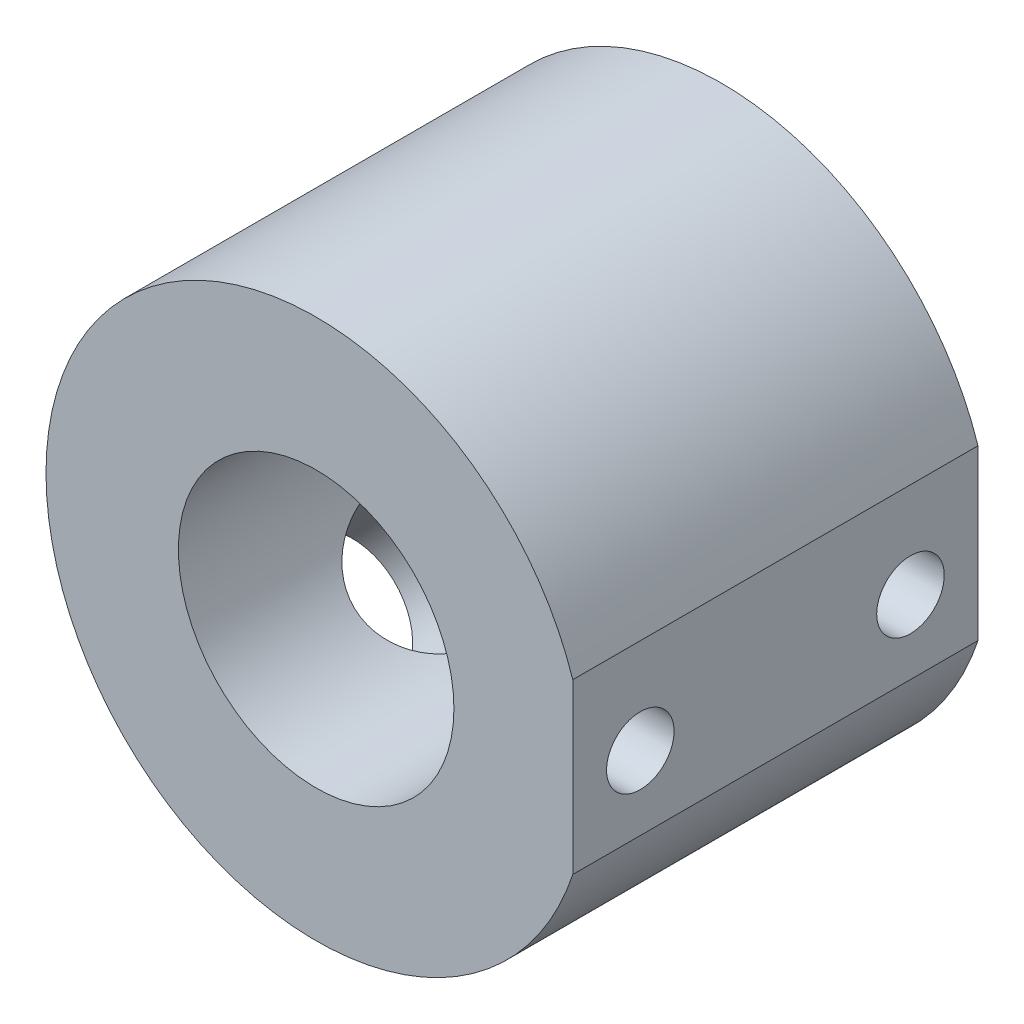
ISO-10303-21;
HEADER;
FILE_DESCRIPTION(('STEP AP214'),'2;1');
FILE_NAME('part.step','',(''),(''),'','','');
FILE_SCHEMA(('AUTOMOTIVE_DESIGN { 1 0 10303 214 1 1 1 1 }'));
ENDSEC;
DATA;
#1=APPLICATION_CONTEXT('core data for automotive mechanical design processes');
#2=APPLICATION_PROTOCOL_DEFINITION('international standard','automotive_design',2000,#1);
#3=PRODUCT_CONTEXT('',#1,'mechanical');
#4=PRODUCT('Part','Part','',(#3));
#5=PRODUCT_RELATED_PRODUCT_CATEGORY('part','',(#4));
#6=PRODUCT_DEFINITION_FORMATION('','',#4);
#7=PRODUCT_DEFINITION_CONTEXT('part definition',#1,'design');
#8=PRODUCT_DEFINITION('design','',#6,#7);
#9=PRODUCT_DEFINITION_SHAPE('','',#8);
#10=(LENGTH_UNIT() NAMED_UNIT(*) SI_UNIT(.MILLI.,.METRE.));
#11=(NAMED_UNIT(*) PLANE_ANGLE_UNIT() SI_UNIT($,.RADIAN.));
#12=(NAMED_UNIT(*) SI_UNIT($,.STERADIAN.) SOLID_ANGLE_UNIT());
#13=UNCERTAINTY_MEASURE_WITH_UNIT(LENGTH_MEASURE(1.E-05),#10,'distance_accuracy_value','');
#14=(GEOMETRIC_REPRESENTATION_CONTEXT(3) GLOBAL_UNCERTAINTY_ASSIGNED_CONTEXT((#13)) GLOBAL_UNIT_ASSIGNED_CONTEXT((#10,
#11,#12)) REPRESENTATION_CONTEXT('',''));
#15=CARTESIAN_POINT('',(0.,0.,0.));
#16=DIRECTION('',(0.,0.,1.));
#17=DIRECTION('',(1.,0.,0.));
#18=AXIS2_PLACEMENT_3D('',#15,#16,#17);
#19=CARTESIAN_POINT('',(0.,0.,7.5));
#20=DIRECTION('',(0.,0.,1.));
#21=DIRECTION('',(1.,0.,0.));
#22=AXIS2_PLACEMENT_3D('',#19,#20,#21);
#23=PLANE('',#22);
#24=DIRECTION('',(0.,-1.,0.));
#25=VECTOR('',#24,1.);
#26=CARTESIAN_POINT('',(9.5,0.,7.5));
#27=LINE('',#26,#25);
#28=CARTESIAN_POINT('',(9.5,3.12249899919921,7.5));
#29=VERTEX_POINT('',#28);
#30=CARTESIAN_POINT('',(9.5,-3.12249899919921,7.5));
#31=VERTEX_POINT('',#30);
#32=EDGE_CURVE('E55',#29,#31,#27,.T.);
#33=ORIENTED_EDGE('',*,*,#32,.F.);
#34=CARTESIAN_POINT('',(0.,0.,7.5));
#35=DIRECTION('',(0.,0.,1.));
#36=DIRECTION('',(1.,0.,0.));
#37=AXIS2_PLACEMENT_3D('',#34,#35,#36);
#38=CIRCLE('',#37,10.);
#39=EDGE_CURVE('E11',#29,#31,#38,.T.);
#40=ORIENTED_EDGE('',*,*,#39,.T.);
#41=EDGE_LOOP('',(#33,#40));
#42=FACE_BOUND('',#41,.T.);
#43=CARTESIAN_POINT('',(0.,0.,7.5));
#44=DIRECTION('',(0.,0.,1.));
#45=DIRECTION('',(1.,0.,0.));
#46=AXIS2_PLACEMENT_3D('',#43,#44,#45);
#47=CIRCLE('',#46,5.1);
#48=CARTESIAN_POINT('',(5.1,0.,7.5));
#49=VERTEX_POINT('',#48);
#50=EDGE_CURVE('E78',#49,#49,#47,.T.);
#51=ORIENTED_EDGE('',*,*,#50,.F.);
#52=EDGE_LOOP('',(#51));
#53=FACE_BOUND('',#52,.T.);
#54=ADVANCED_FACE('F37',(#42,#53),#23,.T.);
#55=CARTESIAN_POINT('',(0.,0.,-7.5));
#56=DIRECTION('',(0.,0.,1.));
#57=DIRECTION('',(1.,0.,0.));
#58=AXIS2_PLACEMENT_3D('',#55,#56,#57);
#59=PLANE('',#58);
#60=CARTESIAN_POINT('',(0.,0.,-7.5));
#61=DIRECTION('',(0.,0.,1.));
#62=DIRECTION('',(1.,0.,0.));
#63=AXIS2_PLACEMENT_3D('',#60,#61,#62);
#64=CIRCLE('',#63,10.);
#65=CARTESIAN_POINT('',(9.5,3.12249899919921,-7.5));
#66=VERTEX_POINT('',#65);
#67=CARTESIAN_POINT('',(9.5,-3.12249899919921,-7.5));
#68=VERTEX_POINT('',#67);
#69=EDGE_CURVE('E47',#66,#68,#64,.T.);
#70=ORIENTED_EDGE('',*,*,#69,.F.);
#71=DIRECTION('',(0.,-1.,0.));
#72=VECTOR('',#71,1.);
#73=CARTESIAN_POINT('',(9.5,0.,-7.5));
#74=LINE('',#73,#72);
#75=EDGE_CURVE('E67',#66,#68,#74,.T.);
#76=ORIENTED_EDGE('',*,*,#75,.T.);
#77=EDGE_LOOP('',(#70,#76));
#78=FACE_BOUND('',#77,.T.);
#79=CARTESIAN_POINT('',(0.,0.,-7.5));
#80=DIRECTION('',(0.,0.,1.));
#81=DIRECTION('',(1.,0.,0.));
#82=AXIS2_PLACEMENT_3D('',#79,#80,#81);
#83=CIRCLE('',#82,5.1);
#84=CARTESIAN_POINT('',(5.1,0.,-7.5));
#85=VERTEX_POINT('',#84);
#86=EDGE_CURVE('E81',#85,#85,#83,.T.);
#87=ORIENTED_EDGE('',*,*,#86,.T.);
#88=EDGE_LOOP('',(#87));
#89=FACE_BOUND('',#88,.T.);
#90=ADVANCED_FACE('F75',(#78,#89),#59,.F.);
#91=CARTESIAN_POINT('',(0.,0.,7.5));
#92=DIRECTION('',(0.,0.,-1.));
#93=DIRECTION('',(-1.,0.,0.));
#94=AXIS2_PLACEMENT_3D('',#91,#92,#93);
#95=CYLINDRICAL_SURFACE('',#94,10.);
#96=CARTESIAN_POINT('',(-8.61429892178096,-5.07876501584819,0.));
#97=CARTESIAN_POINT('',(-8.6142980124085,-5.07876965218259,0.138050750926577));
#98=CARTESIAN_POINT('',(-8.6082962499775,-5.0889886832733,0.276144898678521));
#99=CARTESIAN_POINT('',(-8.58430584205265,-5.12934940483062,0.548367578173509));
#100=CARTESIAN_POINT('',(-8.56631022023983,-5.15950269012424,0.682493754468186));
#101=CARTESIAN_POINT('',(-8.51842944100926,-5.23817352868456,0.942803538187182));
#102=CARTESIAN_POINT('',(-8.48855963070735,-5.28666737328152,1.06899715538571));
#103=CARTESIAN_POINT('',(-8.41704773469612,-5.39979320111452,1.31031085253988));
#104=CARTESIAN_POINT('',(-8.37540514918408,-5.46442586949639,1.42543046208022));
#105=CARTESIAN_POINT('',(-8.27959503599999,-5.60855796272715,1.64386164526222));
#106=CARTESIAN_POINT('',(-8.22519538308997,-5.68832692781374,1.74689360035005));
#107=CARTESIAN_POINT('',(-8.10472415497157,-5.85869554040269,1.93576139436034));
#108=CARTESIAN_POINT('',(-8.03865148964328,-5.94929619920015,2.02159562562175));
#109=CARTESIAN_POINT('',(-7.89452855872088,-6.13928418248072,2.17477546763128));
#110=CARTESIAN_POINT('',(-7.81632402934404,-6.23877647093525,2.24184638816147));
#111=CARTESIAN_POINT('',(-7.64988513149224,-6.44177455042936,2.35380964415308));
#112=CARTESIAN_POINT('',(-7.56165224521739,-6.54527974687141,2.39870525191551));
#113=CARTESIAN_POINT('',(-7.3789465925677,-6.75052840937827,2.46414783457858));
#114=CARTESIAN_POINT('',(-7.28463644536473,-6.85226508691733,2.48516964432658));
#115=CARTESIAN_POINT('',(-7.09070046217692,-7.05275878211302,2.50375837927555));
#116=CARTESIAN_POINT('',(-6.99107541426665,-7.15151623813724,2.5013287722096));
#117=CARTESIAN_POINT('',(-6.7917608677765,-7.34101400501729,2.47342514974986));
#118=CARTESIAN_POINT('',(-6.69212185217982,-7.43188358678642,2.44846367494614));
#119=CARTESIAN_POINT('',(-6.49375949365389,-7.60582013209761,2.3770287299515));
#120=CARTESIAN_POINT('',(-6.39503619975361,-7.68888668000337,2.33055411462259));
#121=CARTESIAN_POINT('',(-6.20087274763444,-7.84633392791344,2.21699742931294));
#122=CARTESIAN_POINT('',(-6.10547031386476,-7.92062936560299,2.14973295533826));
#123=CARTESIAN_POINT('',(-5.92216777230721,-8.05860472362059,1.99664432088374));
#124=CARTESIAN_POINT('',(-5.83426897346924,-8.12228279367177,1.91081693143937));
#125=CARTESIAN_POINT('',(-5.66689661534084,-8.23996639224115,1.72029125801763));
#126=CARTESIAN_POINT('',(-5.5877154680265,-8.29366349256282,1.61514510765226));
#127=CARTESIAN_POINT('',(-5.44380969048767,-8.38882591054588,1.39040002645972));
#128=CARTESIAN_POINT('',(-5.37908573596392,-8.43029065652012,1.2708004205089));
#129=CARTESIAN_POINT('',(-5.26669722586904,-8.50096167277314,1.01970996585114));
#130=CARTESIAN_POINT('',(-5.21911691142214,-8.53010752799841,0.888164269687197));
#131=CARTESIAN_POINT('',(-5.14382872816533,-8.57572065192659,0.617414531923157));
#132=CARTESIAN_POINT('',(-5.11611660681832,-8.59219063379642,0.478212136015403));
#133=CARTESIAN_POINT('',(-5.08248832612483,-8.61212445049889,0.200040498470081));
#134=CARTESIAN_POINT('',(-5.07601582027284,-8.61592031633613,0.0611622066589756));
#135=CARTESIAN_POINT('',(-5.08364269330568,-8.61142245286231,-0.215821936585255));
#136=CARTESIAN_POINT('',(-5.09774017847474,-8.60312983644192,-0.353927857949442));
#137=CARTESIAN_POINT('',(-5.14536527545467,-8.57472775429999,-0.623114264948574));
#138=CARTESIAN_POINT('',(-5.17857120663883,-8.55481385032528,-0.754272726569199));
#139=CARTESIAN_POINT('',(-5.26256380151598,-8.50340117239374,-1.00843145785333));
#140=CARTESIAN_POINT('',(-5.31335254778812,-8.47190102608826,-1.13143075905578));
#141=CARTESIAN_POINT('',(-5.43142203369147,-8.39670354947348,-1.3684412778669));
#142=CARTESIAN_POINT('',(-5.49900675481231,-8.35277906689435,-1.48222884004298));
#143=CARTESIAN_POINT('',(-5.64732251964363,-8.25322417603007,-1.69518836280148));
#144=CARTESIAN_POINT('',(-5.72805572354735,-8.1975918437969,-1.79435791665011));
#145=CARTESIAN_POINT('',(-5.90173750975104,-8.07348418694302,-1.97781104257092));
#146=CARTESIAN_POINT('',(-5.99494119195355,-8.00472234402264,-2.0616600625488));
#147=CARTESIAN_POINT('',(-6.18839734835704,-7.85611817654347,-2.20893586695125));
#148=CARTESIAN_POINT('',(-6.28864945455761,-7.77627643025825,-2.27236371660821));
#149=CARTESIAN_POINT('',(-6.49180993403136,-7.60747665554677,-2.37644603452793));
#150=CARTESIAN_POINT('',(-6.5946934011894,-7.518589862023,-2.41726428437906));
#151=CARTESIAN_POINT('',(-6.80023073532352,-7.33321162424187,-2.47546033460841));
#152=CARTESIAN_POINT('',(-6.9028846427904,-7.23672165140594,-2.49284265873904));
#153=CARTESIAN_POINT('',(-7.10187154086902,-7.04147215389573,-2.50341897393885));
#154=CARTESIAN_POINT('',(-7.19830039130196,-6.94284453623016,-2.49725427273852));
#155=CARTESIAN_POINT('',(-7.38506999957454,-6.74383906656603,-2.46238043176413));
#156=CARTESIAN_POINT('',(-7.47541093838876,-6.64346126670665,-2.43367196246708));
#157=CARTESIAN_POINT('',(-7.6474046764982,-6.44471844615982,-2.35486945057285));
#158=CARTESIAN_POINT('',(-7.72910162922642,-6.34634549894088,-2.30489136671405));
#159=CARTESIAN_POINT('',(-7.88287932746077,-6.15429650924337,-2.18507355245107));
#160=CARTESIAN_POINT('',(-7.95495885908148,-6.06062106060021,-2.11523131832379));
#161=CARTESIAN_POINT('',(-8.0901402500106,-5.87901052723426,-1.95571191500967));
#162=CARTESIAN_POINT('',(-8.15298566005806,-5.79126672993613,-1.86559964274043));
#163=CARTESIAN_POINT('',(-8.26700018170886,-5.62731746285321,-1.66894287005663));
#164=CARTESIAN_POINT('',(-8.31816632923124,-5.55111492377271,-1.56239420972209));
#165=CARTESIAN_POINT('',(-8.40933242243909,-5.41204103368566,-1.33349646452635));
#166=CARTESIAN_POINT('',(-8.44910624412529,-5.34944491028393,-1.21088969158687));
#167=CARTESIAN_POINT('',(-8.51598121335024,-5.24233527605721,-0.954861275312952));
#168=CARTESIAN_POINT('',(-8.54309158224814,-5.19780861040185,-0.821447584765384));
#169=CARTESIAN_POINT('',(-8.58063758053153,-5.13553369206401,-0.573557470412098));
#170=CARTESIAN_POINT('',(-8.59325622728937,-5.11431500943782,-0.460267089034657));
#171=CARTESIAN_POINT('',(-8.61008692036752,-5.08592932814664,-0.231327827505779));
#172=CARTESIAN_POINT('',(-8.61429968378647,-5.07876113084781,-0.115679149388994));
#173=CARTESIAN_POINT('',(-8.61429892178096,-5.07876501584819,0.));
#174=B_SPLINE_CURVE_WITH_KNOTS('',3,(#96,#97,#98,#99,#100,#101,#102,#103,#104,#105,#106,#107,
#108,#109,#110,#111,#112,#113,#114,#115,#116,#117,#118,#119,#120,#121,#122,#123,#124,#125,#126,
#127,#128,#129,#130,#131,#132,#133,#134,#135,#136,#137,#138,#139,#140,#141,#142,#143,#144,#145,
#146,#147,#148,#149,#150,#151,#152,#153,#154,#155,#156,#157,#158,#159,#160,#161,#162,#163,#164,
#165,#166,#167,#168,#169,#170,#171,#172,#173),.UNSPECIFIED.,.T.,.F.,(4,2,2,2,2,2,2,2,2,2,2,2,2,
2,2,2,2,2,2,2,2,2,2,2,2,2,2,2,2,2,2,2,2,2,2,2,2,2,4),(0.,0.413727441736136,0.827695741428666,
1.24113072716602,1.65458326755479,2.07623954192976,2.49793521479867,2.9255149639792,
3.35303159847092,3.77188750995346,4.19068148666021,4.60018262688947,5.00970556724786,
5.42292874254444,5.83622385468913,6.26070466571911,6.68520531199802,7.11176432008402,
7.53823200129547,7.95343574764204,8.36860127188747,8.77697405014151,9.18539521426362,
9.60182845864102,10.0183301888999,10.4452533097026,10.872154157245,11.2959207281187,
11.7196054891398,12.131834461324,12.5440511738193,12.9540487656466,13.3640980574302,
13.7839709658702,14.2039503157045,14.6317647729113,15.0592672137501,15.4059782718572,
15.7526597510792),.UNSPECIFIED.);
#175=CARTESIAN_POINT('',(-8.61429892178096,-5.07876501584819,0.));
#176=VERTEX_POINT('',#175);
#177=EDGE_CURVE('E118',#176,#176,#174,.T.);
#178=ORIENTED_EDGE('',*,*,#177,.T.);
#179=EDGE_LOOP('',(#178));
#180=FACE_BOUND('',#179,.T.);
#181=ORIENTED_EDGE('',*,*,#39,.F.);
#182=DIRECTION('',(0.,0.,-1.));
#183=VECTOR('',#182,1.);
#184=CARTESIAN_POINT('',(9.5,3.12249899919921,7.5));
#185=LINE('',#184,#183);
#186=EDGE_CURVE('E60',#29,#66,#185,.T.);
#187=ORIENTED_EDGE('',*,*,#186,.T.);
#188=ORIENTED_EDGE('',*,*,#69,.T.);
#189=DIRECTION('',(0.,0.,-1.));
#190=VECTOR('',#189,1.);
#191=CARTESIAN_POINT('',(9.5,-3.12249899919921,7.5));
#192=LINE('',#191,#190);
#193=EDGE_CURVE('E64',#68,#31,#192,.F.);
#194=ORIENTED_EDGE('',*,*,#193,.T.);
#195=EDGE_LOOP('',(#181,#187,#188,#194));
#196=FACE_BOUND('',#195,.T.);
#197=ADVANCED_FACE('F39',(#180,#196),#95,.T.);
#198=CARTESIAN_POINT('',(0.,0.,7.5));
#199=DIRECTION('',(0.,0.,-1.));
#200=DIRECTION('',(-1.,0.,0.));
#201=AXIS2_PLACEMENT_3D('',#198,#199,#200);
#202=CYLINDRICAL_SURFACE('',#201,5.1);
#203=CARTESIAN_POINT('',(-4.91101368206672,-1.37547977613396,0.));
#204=CARTESIAN_POINT('',(-4.91101506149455,-1.37549540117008,0.130659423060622));
#205=CARTESIAN_POINT('',(-4.90785749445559,-1.38690665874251,0.261497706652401));
#206=CARTESIAN_POINT('',(-4.89499868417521,-1.43160546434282,0.519187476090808));
#207=CARTESIAN_POINT('',(-4.88528315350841,-1.46494077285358,0.646029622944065));
#208=CARTESIAN_POINT('',(-4.85875019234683,-1.55065442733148,0.891520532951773));
#209=CARTESIAN_POINT('',(-4.84196931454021,-1.60293457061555,1.01020786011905));
#210=CARTESIAN_POINT('',(-4.80044356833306,-1.72330561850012,1.23767586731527));
#211=CARTESIAN_POINT('',(-4.77569853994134,-1.79139684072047,1.34645634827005));
#212=CARTESIAN_POINT('',(-4.7149089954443,-1.94603632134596,1.560533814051));
#213=CARTESIAN_POINT('',(-4.67812546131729,-2.03361855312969,1.66487448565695));
#214=CARTESIAN_POINT('',(-4.5928154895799,-2.21957482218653,1.85806528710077));
#215=CARTESIAN_POINT('',(-4.54428341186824,-2.31795403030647,1.94690794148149));
#216=CARTESIAN_POINT('',(-4.43090341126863,-2.52828923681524,2.11215445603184));
#217=CARTESIAN_POINT('',(-4.36520832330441,-2.64071135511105,2.18739423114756));
#218=CARTESIAN_POINT('',(-4.21887020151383,-2.86869840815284,2.31518348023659));
#219=CARTESIAN_POINT('',(-4.13823628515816,-2.98426138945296,2.36774672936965));
#220=CARTESIAN_POINT('',(-3.96893372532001,-3.20556032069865,2.44494402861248));
#221=CARTESIAN_POINT('',(-3.8812002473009,-3.31142513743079,2.47125156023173));
#222=CARTESIAN_POINT('',(-3.69562082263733,-3.51732163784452,2.50068895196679));
#223=CARTESIAN_POINT('',(-3.59778075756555,-3.61735666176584,2.5038322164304));
#224=CARTESIAN_POINT('',(-3.40379216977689,-3.80006235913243,2.48752707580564));
#225=CARTESIAN_POINT('',(-3.30818695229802,-3.88348559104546,2.46994674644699));
#226=CARTESIAN_POINT('',(-3.11433962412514,-4.04060125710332,2.41601870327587));
#227=CARTESIAN_POINT('',(-3.01609731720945,-4.11429296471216,2.37966958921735));
#228=CARTESIAN_POINT('',(-2.81879945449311,-4.25194770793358,2.28896538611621));
#229=CARTESIAN_POINT('',(-2.71975221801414,-4.31575739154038,2.23436144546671));
#230=CARTESIAN_POINT('',(-2.52542505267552,-4.432277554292,2.10902364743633));
#231=CARTESIAN_POINT('',(-2.43014650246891,-4.4849840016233,2.03828395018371));
#232=CARTESIAN_POINT('',(-2.23792514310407,-4.5841502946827,1.8752127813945));
#233=CARTESIAN_POINT('',(-2.14163209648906,-4.62959292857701,1.78149553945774));
#234=CARTESIAN_POINT('',(-1.96091524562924,-4.7089886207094,1.57885755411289));
#235=CARTESIAN_POINT('',(-1.87649997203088,-4.74293344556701,1.46992599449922));
#236=CARTESIAN_POINT('',(-1.71905250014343,-4.80232856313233,1.23202572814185));
#237=CARTESIAN_POINT('',(-1.64699085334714,-4.82715653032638,1.10225231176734));
#238=CARTESIAN_POINT('',(-1.525849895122,-4.86681486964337,0.83099045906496));
#239=CARTESIAN_POINT('',(-1.47674739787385,-4.88165533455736,0.689514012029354));
#240=CARTESIAN_POINT('',(-1.40876388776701,-4.90168918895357,0.410524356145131));
#241=CARTESIAN_POINT('',(-1.38782087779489,-4.90754588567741,0.273565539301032));
#242=CARTESIAN_POINT('',(-1.37129183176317,-4.91219428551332,-0.00195927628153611));
#243=CARTESIAN_POINT('',(-1.37568942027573,-4.91099055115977,-0.140524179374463));
#244=CARTESIAN_POINT('',(-1.40759091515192,-4.90192761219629,-0.400114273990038));
#245=CARTESIAN_POINT('',(-1.43266514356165,-4.89476757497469,-0.521474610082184));
#246=CARTESIAN_POINT('',(-1.50090522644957,-4.87427356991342,-0.758435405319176));
#247=CARTESIAN_POINT('',(-1.54407666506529,-4.86093769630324,-0.874034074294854));
#248=CARTESIAN_POINT('',(-1.64823704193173,-4.82663877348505,-1.10227901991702));
#249=CARTESIAN_POINT('',(-1.70996020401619,-4.80535033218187,-1.21453899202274));
#250=CARTESIAN_POINT('',(-1.84710441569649,-4.75431970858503,-1.42825575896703));
#251=CARTESIAN_POINT('',(-1.92253245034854,-4.72457321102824,-1.52970700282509));
#252=CARTESIAN_POINT('',(-2.09371713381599,-4.6514519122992,-1.7316774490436));
#253=CARTESIAN_POINT('',(-2.19082748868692,-4.60686878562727,-1.83061891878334));
#254=CARTESIAN_POINT('',(-2.39422111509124,-4.50451581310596,-2.01075339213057));
#255=CARTESIAN_POINT('',(-2.50050709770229,-4.44674206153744,-2.09194112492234));
#256=CARTESIAN_POINT('',(-2.72050956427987,-4.31573430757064,-2.23576508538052));
#257=CARTESIAN_POINT('',(-2.83433970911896,-4.24218032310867,-2.29794042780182));
#258=CARTESIAN_POINT('',(-3.06227530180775,-4.08067564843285,-2.39851328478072));
#259=CARTESIAN_POINT('',(-3.17638043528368,-3.9927371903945,-2.43693087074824));
#260=CARTESIAN_POINT('',(-3.38985290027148,-3.81269340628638,-2.48570742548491));
#261=CARTESIAN_POINT('',(-3.48962571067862,-3.72166382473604,-2.498268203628));
#262=CARTESIAN_POINT('',(-3.68172133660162,-3.53173410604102,-2.50139516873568));
#263=CARTESIAN_POINT('',(-3.77404654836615,-3.43283652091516,-2.49196845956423));
#264=CARTESIAN_POINT('',(-3.94313152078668,-3.23688807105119,-2.45287603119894));
#265=CARTESIAN_POINT('',(-4.02050035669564,-3.14010015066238,-2.42449576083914));
#266=CARTESIAN_POINT('',(-4.16500123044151,-2.94574931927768,-2.34999169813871));
#267=CARTESIAN_POINT('',(-4.23213174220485,-2.8481862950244,-2.30386526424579));
#268=CARTESIAN_POINT('',(-4.35841108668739,-2.65114091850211,-2.19304735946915));
#269=CARTESIAN_POINT('',(-4.4170818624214,-2.55176151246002,-2.12763157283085));
#270=CARTESIAN_POINT('',(-4.5230913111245,-2.35876836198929,-1.98101631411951));
#271=CARTESIAN_POINT('',(-4.57042474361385,-2.26515729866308,-1.89980957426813));
#272=CARTESIAN_POINT('',(-4.65858677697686,-2.07827863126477,-1.71484463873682));
#273=CARTESIAN_POINT('',(-4.69835405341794,-1.98590746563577,-1.60966962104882));
#274=CARTESIAN_POINT('',(-4.76659169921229,-1.81603965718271,-1.38452865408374));
#275=CARTESIAN_POINT('',(-4.79505273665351,-1.73855532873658,-1.26455059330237));
#276=CARTESIAN_POINT('',(-4.84266936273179,-1.60125278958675,-1.00880581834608));
#277=CARTESIAN_POINT('',(-4.86156591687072,-1.54194195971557,-0.872711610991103));
#278=CARTESIAN_POINT('',(-4.88299516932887,-1.47205143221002,-0.661923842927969));
#279=CARTESIAN_POINT('',(-4.88898333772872,-1.45194354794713,-0.590621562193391));
#280=CARTESIAN_POINT('',(-4.89879291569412,-1.41849823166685,-0.446317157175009));
#281=CARTESIAN_POINT('',(-4.9026158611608,-1.40515600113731,-0.37331627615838));
#282=CARTESIAN_POINT('',(-4.90727539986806,-1.38877417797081,-0.250157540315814));
#283=CARTESIAN_POINT('',(-4.90867842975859,-1.38379657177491,-0.200270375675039));
#284=CARTESIAN_POINT('',(-4.91054733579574,-1.37714626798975,-0.100264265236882));
#285=CARTESIAN_POINT('',(-4.91101315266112,-1.37547377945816,-0.0501453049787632));
#286=CARTESIAN_POINT('',(-4.91101368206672,-1.37547977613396,0.));
#287=B_SPLINE_CURVE_WITH_KNOTS('',3,(#203,#204,#205,#206,#207,#208,#209,#210,#211,#212,#213,
#214,#215,#216,#217,#218,#219,#220,#221,#222,#223,#224,#225,#226,#227,#228,#229,#230,#231,#232,
#233,#234,#235,#236,#237,#238,#239,#240,#241,#242,#243,#244,#245,#246,#247,#248,#249,#250,#251,
#252,#253,#254,#255,#256,#257,#258,#259,#260,#261,#262,#263,#264,#265,#266,#267,#268,#269,#270,
#271,#272,#273,#274,#275,#276,#277,#278,#279,#280,#281,#282,#283,#284,#285,#286),.UNSPECIFIED.,
.T.,.F.,(4,2,2,2,2,2,2,2,2,2,2,2,2,2,2,2,2,2,2,2,2,2,2,2,2,2,2,2,2,2,2,2,2,2,2,2,2,2,2,2,2,4),
(0.,0.391776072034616,0.784408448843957,1.17503402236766,1.56566744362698,1.98720279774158,
2.40894092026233,2.85774290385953,3.30627187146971,3.72392562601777,4.14133768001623,
4.52382797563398,4.90634681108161,5.29430859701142,5.68241101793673,6.10613158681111,
6.5301549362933,6.97929689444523,7.42798429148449,7.84160522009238,8.25495889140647,
8.62568423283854,8.99652405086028,9.38458260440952,9.77283950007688,10.2077637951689,
10.6428170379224,11.0877054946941,11.5322175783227,11.9369815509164,12.3416147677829,
12.7212666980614,13.1009751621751,13.4973059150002,13.8938195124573,14.328414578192,
14.7633676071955,15.2095427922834,15.4322245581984,15.6547481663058,15.805096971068,
15.9554552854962),.UNSPECIFIED.);
#288=CARTESIAN_POINT('',(-4.91101368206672,-1.37547977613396,0.));
#289=VERTEX_POINT('',#288);
#290=EDGE_CURVE('E114',#289,#289,#287,.T.);
#291=ORIENTED_EDGE('',*,*,#290,.F.);
#292=EDGE_LOOP('',(#291));
#293=FACE_BOUND('',#292,.T.);
#294=CARTESIAN_POINT('',(5.08420527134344,-0.401069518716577,6.25));
#295=CARTESIAN_POINT('',(5.08960441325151,-0.332615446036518,6.24999842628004));
#296=CARTESIAN_POINT('',(5.09361086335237,-0.26403367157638,6.24435896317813));
#297=CARTESIAN_POINT('',(5.09882926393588,-0.128603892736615,6.22187471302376));
#298=CARTESIAN_POINT('',(5.10004013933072,-0.0617565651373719,6.20502561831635));
#299=CARTESIAN_POINT('',(5.09995781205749,0.0682210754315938,6.16059487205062));
#300=CARTESIAN_POINT('',(5.09866609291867,0.131353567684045,6.13301958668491));
#301=CARTESIAN_POINT('',(5.09412056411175,0.252182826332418,6.06792879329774));
#302=CARTESIAN_POINT('',(5.09086668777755,0.309879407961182,6.03041294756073));
#303=CARTESIAN_POINT('',(5.08307130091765,0.418808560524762,5.94609131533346));
#304=CARTESIAN_POINT('',(5.07851788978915,0.469974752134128,5.89920092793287));
#305=CARTESIAN_POINT('',(5.06895566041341,0.563843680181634,5.79763735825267));
#306=CARTESIAN_POINT('',(5.06394679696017,0.606545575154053,5.7429634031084));
#307=CARTESIAN_POINT('',(5.05420816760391,0.683005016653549,5.62628306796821));
#308=CARTESIAN_POINT('',(5.04948474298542,0.716594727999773,5.56416603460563));
#309=CARTESIAN_POINT('',(5.04117860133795,0.772872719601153,5.4351035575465));
#310=CARTESIAN_POINT('',(5.03759583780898,0.795561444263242,5.36815831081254));
#311=CARTESIAN_POINT('',(5.03215367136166,0.829290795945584,5.23160282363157));
#312=CARTESIAN_POINT('',(5.03028757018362,0.840376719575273,5.16200405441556));
#313=CARTESIAN_POINT('',(5.02855060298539,0.85071009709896,5.0219112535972));
#314=CARTESIAN_POINT('',(5.02867957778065,0.849958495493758,4.95141729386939));
#315=CARTESIAN_POINT('',(5.03089812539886,0.83672360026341,4.81242586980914));
#316=CARTESIAN_POINT('',(5.0329642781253,0.824380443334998,4.7439146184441));
#317=CARTESIAN_POINT('',(5.03870354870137,0.788538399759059,4.60994651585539));
#318=CARTESIAN_POINT('',(5.04237674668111,0.765038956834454,4.54448981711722));
#319=CARTESIAN_POINT('',(5.05078201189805,0.707423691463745,4.41811571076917));
#320=CARTESIAN_POINT('',(5.05551918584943,0.673256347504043,4.35722214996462));
#321=CARTESIAN_POINT('',(5.06529049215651,0.595290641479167,4.24197116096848));
#322=CARTESIAN_POINT('',(5.07032465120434,0.551491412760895,4.18761432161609));
#323=CARTESIAN_POINT('',(5.07990924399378,0.454864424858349,4.0863071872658));
#324=CARTESIAN_POINT('',(5.08445320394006,0.401935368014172,4.03945279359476));
#325=CARTESIAN_POINT('',(5.09212663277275,0.288877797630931,3.95528071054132));
#326=CARTESIAN_POINT('',(5.0952561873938,0.228749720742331,3.91796244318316));
#327=CARTESIAN_POINT('',(5.09933207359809,0.103470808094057,3.85420707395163));
#328=CARTESIAN_POINT('',(5.10029455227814,0.0383608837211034,3.82769070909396));
#329=CARTESIAN_POINT('',(5.09954617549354,-0.0953620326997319,3.78593766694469));
#330=CARTESIAN_POINT('',(5.09783573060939,-0.163974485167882,3.77069925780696));
#331=CARTESIAN_POINT('',(5.09154800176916,-0.301279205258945,3.75210270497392));
#332=CARTESIAN_POINT('',(5.08702773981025,-0.369943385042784,3.74851688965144));
#333=CARTESIAN_POINT('',(5.0752312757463,-0.506693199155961,3.75259333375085));
#334=CARTESIAN_POINT('',(5.0679550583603,-0.574778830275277,3.76025565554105));
#335=CARTESIAN_POINT('',(5.05098019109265,-0.708634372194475,3.78650664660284));
#336=CARTESIAN_POINT('',(5.0412765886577,-0.774399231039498,3.80511776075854));
#337=CARTESIAN_POINT('',(5.0200567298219,-0.901778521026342,3.85264904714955));
#338=CARTESIAN_POINT('',(5.00854015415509,-0.963392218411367,3.88157103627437));
#339=CARTESIAN_POINT('',(4.98411055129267,-1.08280804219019,3.94994652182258));
#340=CARTESIAN_POINT('',(4.97116524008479,-1.14043211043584,3.98969948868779));
#341=CARTESIAN_POINT('',(4.94519335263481,-1.24825628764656,4.07823914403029));
#342=CARTESIAN_POINT('',(4.93216675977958,-1.29845482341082,4.12702774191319));
#343=CARTESIAN_POINT('',(4.90682200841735,-1.39121085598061,4.23369015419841));
#344=CARTESIAN_POINT('',(4.89452776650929,-1.43356050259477,4.29175091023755));
#345=CARTESIAN_POINT('',(4.87215880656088,-1.50783939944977,4.4145864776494));
#346=CARTESIAN_POINT('',(4.86208372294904,-1.53977036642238,4.4793601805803));
#347=CARTESIAN_POINT('',(4.8453974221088,-1.59149295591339,4.61224400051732));
#348=CARTESIAN_POINT('',(4.8387106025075,-1.61155138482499,4.68024044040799));
#349=CARTESIAN_POINT('',(4.82917728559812,-1.63990118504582,4.81889708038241));
#350=CARTESIAN_POINT('',(4.8263293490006,-1.64819696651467,4.889556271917));
#351=CARTESIAN_POINT('',(4.82482962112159,-1.65258033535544,5.0278708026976));
#352=CARTESIAN_POINT('',(4.8259820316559,-1.64923755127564,5.09550661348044));
#353=CARTESIAN_POINT('',(4.83193067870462,-1.6317260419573,5.22919143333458));
#354=CARTESIAN_POINT('',(4.83672680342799,-1.61755764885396,5.29524049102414));
#355=CARTESIAN_POINT('',(4.8494240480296,-1.57907836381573,5.42335851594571));
#356=CARTESIAN_POINT('',(4.8572981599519,-1.55485558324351,5.48545678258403));
#357=CARTESIAN_POINT('',(4.87542375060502,-1.49704943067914,5.60475101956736));
#358=CARTESIAN_POINT('',(4.8856756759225,-1.46346430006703,5.66194606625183));
#359=CARTESIAN_POINT('',(4.90814717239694,-1.38627890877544,5.77239167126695));
#360=CARTESIAN_POINT('',(4.92043104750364,-1.34231889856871,5.8253776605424));
#361=CARTESIAN_POINT('',(4.94559988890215,-1.24639382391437,5.92338031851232));
#362=CARTESIAN_POINT('',(4.95848506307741,-1.19442597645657,5.96839420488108));
#363=CARTESIAN_POINT('',(4.98433748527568,-1.08159781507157,6.05093013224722));
#364=CARTESIAN_POINT('',(4.99728844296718,-1.02047030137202,6.08809280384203));
#365=CARTESIAN_POINT('',(5.02170961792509,-0.892558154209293,6.15153321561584));
#366=CARTESIAN_POINT('',(5.03318071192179,-0.82577690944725,6.17781742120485));
#367=CARTESIAN_POINT('',(5.05211987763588,-0.699620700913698,6.21530451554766));
#368=CARTESIAN_POINT('',(5.05993571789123,-0.640815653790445,6.22826859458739));
#369=CARTESIAN_POINT('',(5.07359712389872,-0.521729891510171,6.24561643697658));
#370=CARTESIAN_POINT('',(5.07944296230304,-0.461449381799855,6.2500013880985));
#371=CARTESIAN_POINT('',(5.08420527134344,-0.401069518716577,6.25));
#372=B_SPLINE_CURVE_WITH_KNOTS('',3,(#294,#295,#296,#297,#298,#299,#300,#301,#302,#303,#304,
#305,#306,#307,#308,#309,#310,#311,#312,#313,#314,#315,#316,#317,#318,#319,#320,#321,#322,#323,
#324,#325,#326,#327,#328,#329,#330,#331,#332,#333,#334,#335,#336,#337,#338,#339,#340,#341,#342,
#343,#344,#345,#346,#347,#348,#349,#350,#351,#352,#353,#354,#355,#356,#357,#358,#359,#360,#361,
#362,#363,#364,#365,#366,#367,#368,#369,#370,#371),.UNSPECIFIED.,.T.,.F.,(4,2,2,2,2,2,2,2,2,2,2,
2,2,2,2,2,2,2,2,2,2,2,2,2,2,2,2,2,2,2,2,2,2,2,2,2,2,2,4),(0.,0.205783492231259,
0.411646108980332,0.61738672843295,0.823134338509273,1.03083012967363,1.23854655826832,
1.44986281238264,1.66117045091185,1.87165004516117,2.08211284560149,2.29006355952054,
2.49802464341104,2.70700604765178,2.91600626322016,3.12749516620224,3.33897124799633,
3.54886631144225,3.75872913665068,3.9644661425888,4.17020428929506,4.37636567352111,
4.58256340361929,4.79517185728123,5.00782529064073,5.22548806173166,5.44311494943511,
5.65564466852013,5.86809468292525,6.07029591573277,6.27249094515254,6.47295025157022,
6.6734472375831,6.8823193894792,7.09126429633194,7.30833376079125,7.52527402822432,
7.70681033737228,7.88832151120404),.UNSPECIFIED.);
#373=CARTESIAN_POINT('',(5.08420527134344,-0.401069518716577,6.25));
#374=VERTEX_POINT('',#373);
#375=EDGE_CURVE('E92',#374,#374,#372,.T.);
#376=ORIENTED_EDGE('',*,*,#375,.F.);
#377=EDGE_LOOP('',(#376));
#378=FACE_BOUND('',#377,.T.);
#379=CARTESIAN_POINT('',(5.08420527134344,-0.401069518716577,-3.75));
#380=CARTESIAN_POINT('',(5.08960441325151,-0.332615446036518,-3.75000157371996));
#381=CARTESIAN_POINT('',(5.09361086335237,-0.26403367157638,-3.75564103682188));
#382=CARTESIAN_POINT('',(5.09882926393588,-0.128603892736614,-3.77812528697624));
#383=CARTESIAN_POINT('',(5.10004013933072,-0.0617565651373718,-3.79497438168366));
#384=CARTESIAN_POINT('',(5.09995781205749,0.0682210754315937,-3.83940512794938));
#385=CARTESIAN_POINT('',(5.09866609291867,0.131353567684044,-3.86698041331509));
#386=CARTESIAN_POINT('',(5.09412056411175,0.252182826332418,-3.93207120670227));
#387=CARTESIAN_POINT('',(5.09086668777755,0.309879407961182,-3.96958705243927));
#388=CARTESIAN_POINT('',(5.08307130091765,0.418808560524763,-4.05390868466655));
#389=CARTESIAN_POINT('',(5.07851788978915,0.469974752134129,-4.10079907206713));
#390=CARTESIAN_POINT('',(5.06895566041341,0.563843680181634,-4.20236264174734));
#391=CARTESIAN_POINT('',(5.06394679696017,0.606545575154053,-4.25703659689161));
#392=CARTESIAN_POINT('',(5.05420816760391,0.683005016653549,-4.37371693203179));
#393=CARTESIAN_POINT('',(5.04948474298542,0.716594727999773,-4.43583396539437));
#394=CARTESIAN_POINT('',(5.04117860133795,0.772872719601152,-4.5648964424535));
#395=CARTESIAN_POINT('',(5.03759583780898,0.795561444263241,-4.63184168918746));
#396=CARTESIAN_POINT('',(5.03215367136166,0.829290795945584,-4.76839717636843));
#397=CARTESIAN_POINT('',(5.03028757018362,0.840376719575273,-4.83799594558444));
#398=CARTESIAN_POINT('',(5.02855060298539,0.85071009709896,-4.9780887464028));
#399=CARTESIAN_POINT('',(5.02867957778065,0.849958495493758,-5.04858270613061));
#400=CARTESIAN_POINT('',(5.03089812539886,0.836723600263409,-5.18757413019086));
#401=CARTESIAN_POINT('',(5.0329642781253,0.824380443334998,-5.2560853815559));
#402=CARTESIAN_POINT('',(5.03870354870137,0.788538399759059,-5.39005348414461));
#403=CARTESIAN_POINT('',(5.04237674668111,0.765038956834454,-5.45551018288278));
#404=CARTESIAN_POINT('',(5.05078201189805,0.707423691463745,-5.58188428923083));
#405=CARTESIAN_POINT('',(5.05551918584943,0.673256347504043,-5.64277785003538));
#406=CARTESIAN_POINT('',(5.0652904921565,0.595290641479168,-5.75802883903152));
#407=CARTESIAN_POINT('',(5.07032465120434,0.551491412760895,-5.81238567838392));
#408=CARTESIAN_POINT('',(5.07990924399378,0.454864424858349,-5.9136928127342));
#409=CARTESIAN_POINT('',(5.08445320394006,0.401935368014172,-5.96054720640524));
#410=CARTESIAN_POINT('',(5.09212663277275,0.288877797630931,-6.04471928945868));
#411=CARTESIAN_POINT('',(5.0952561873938,0.228749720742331,-6.08203755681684));
#412=CARTESIAN_POINT('',(5.09933207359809,0.103470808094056,-6.14579292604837));
#413=CARTESIAN_POINT('',(5.10029455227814,0.0383608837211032,-6.17230929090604));
#414=CARTESIAN_POINT('',(5.09954617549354,-0.0953620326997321,-6.21406233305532));
#415=CARTESIAN_POINT('',(5.09783573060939,-0.163974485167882,-6.22930074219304));
#416=CARTESIAN_POINT('',(5.09154800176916,-0.301279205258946,-6.24789729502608));
#417=CARTESIAN_POINT('',(5.08702773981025,-0.369943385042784,-6.25148311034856));
#418=CARTESIAN_POINT('',(5.0752312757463,-0.506693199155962,-6.24740666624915));
#419=CARTESIAN_POINT('',(5.0679550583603,-0.574778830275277,-6.23974434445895));
#420=CARTESIAN_POINT('',(5.05098019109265,-0.708634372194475,-6.21349335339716));
#421=CARTESIAN_POINT('',(5.0412765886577,-0.774399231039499,-6.19488223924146));
#422=CARTESIAN_POINT('',(5.0200567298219,-0.901778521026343,-6.14735095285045));
#423=CARTESIAN_POINT('',(5.00854015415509,-0.963392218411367,-6.11842896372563));
#424=CARTESIAN_POINT('',(4.98411055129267,-1.08280804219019,-6.05005347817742));
#425=CARTESIAN_POINT('',(4.97116524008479,-1.14043211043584,-6.01030051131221));
#426=CARTESIAN_POINT('',(4.94519335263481,-1.24825628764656,-5.92176085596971));
#427=CARTESIAN_POINT('',(4.93216675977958,-1.29845482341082,-5.87297225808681));
#428=CARTESIAN_POINT('',(4.90682200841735,-1.39121085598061,-5.76630984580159));
#429=CARTESIAN_POINT('',(4.89452776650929,-1.43356050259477,-5.70824908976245));
#430=CARTESIAN_POINT('',(4.87215880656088,-1.50783939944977,-5.5854135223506));
#431=CARTESIAN_POINT('',(4.86208372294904,-1.53977036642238,-5.5206398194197));
#432=CARTESIAN_POINT('',(4.8453974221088,-1.59149295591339,-5.38775599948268));
#433=CARTESIAN_POINT('',(4.8387106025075,-1.61155138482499,-5.31975955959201));
#434=CARTESIAN_POINT('',(4.82917728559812,-1.63990118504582,-5.18110291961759));
#435=CARTESIAN_POINT('',(4.8263293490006,-1.64819696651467,-5.110443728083));
#436=CARTESIAN_POINT('',(4.82482962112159,-1.65258033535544,-4.9721291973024));
#437=CARTESIAN_POINT('',(4.8259820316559,-1.64923755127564,-4.90449338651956));
#438=CARTESIAN_POINT('',(4.83193067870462,-1.6317260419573,-4.77080856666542));
#439=CARTESIAN_POINT('',(4.83672680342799,-1.61755764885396,-4.70475950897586));
#440=CARTESIAN_POINT('',(4.8494240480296,-1.57907836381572,-4.57664148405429));
#441=CARTESIAN_POINT('',(4.8572981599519,-1.55485558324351,-4.51454321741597));
#442=CARTESIAN_POINT('',(4.87542375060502,-1.49704943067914,-4.39524898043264));
#443=CARTESIAN_POINT('',(4.8856756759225,-1.46346430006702,-4.33805393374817));
#444=CARTESIAN_POINT('',(4.90814717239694,-1.38627890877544,-4.22760832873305));
#445=CARTESIAN_POINT('',(4.92043104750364,-1.34231889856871,-4.1746223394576));
#446=CARTESIAN_POINT('',(4.94559988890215,-1.24639382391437,-4.07661968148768));
#447=CARTESIAN_POINT('',(4.95848506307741,-1.19442597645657,-4.03160579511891));
#448=CARTESIAN_POINT('',(4.98433748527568,-1.08159781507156,-3.94906986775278));
#449=CARTESIAN_POINT('',(4.99728844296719,-1.02047030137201,-3.91190719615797));
#450=CARTESIAN_POINT('',(5.02170961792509,-0.892558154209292,-3.84846678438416));
#451=CARTESIAN_POINT('',(5.03318071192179,-0.825776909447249,-3.82218257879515));
#452=CARTESIAN_POINT('',(5.05211987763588,-0.699620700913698,-3.78469548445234));
#453=CARTESIAN_POINT('',(5.05993571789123,-0.640815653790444,-3.77173140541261));
#454=CARTESIAN_POINT('',(5.07359712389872,-0.52172989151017,-3.75438356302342));
#455=CARTESIAN_POINT('',(5.07944296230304,-0.461449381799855,-3.7499986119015));
#456=CARTESIAN_POINT('',(5.08420527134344,-0.401069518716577,-3.75));
#457=B_SPLINE_CURVE_WITH_KNOTS('',3,(#379,#380,#381,#382,#383,#384,#385,#386,#387,#388,#389,
#390,#391,#392,#393,#394,#395,#396,#397,#398,#399,#400,#401,#402,#403,#404,#405,#406,#407,#408,
#409,#410,#411,#412,#413,#414,#415,#416,#417,#418,#419,#420,#421,#422,#423,#424,#425,#426,#427,
#428,#429,#430,#431,#432,#433,#434,#435,#436,#437,#438,#439,#440,#441,#442,#443,#444,#445,#446,
#447,#448,#449,#450,#451,#452,#453,#454,#455,#456),.UNSPECIFIED.,.T.,.F.,(4,2,2,2,2,2,2,2,2,2,2,
2,2,2,2,2,2,2,2,2,2,2,2,2,2,2,2,2,2,2,2,2,2,2,2,2,2,2,4),(0.,0.205783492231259,
0.411646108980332,0.617386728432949,0.823134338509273,1.03083012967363,1.23854655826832,
1.44986281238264,1.66117045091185,1.87165004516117,2.08211284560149,2.29006355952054,
2.49802464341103,2.70700604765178,2.91600626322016,3.12749516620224,3.33897124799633,
3.54886631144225,3.75872913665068,3.9644661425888,4.17020428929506,4.37636567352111,
4.58256340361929,4.79517185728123,5.00782529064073,5.22548806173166,5.44311494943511,
5.65564466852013,5.86809468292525,6.07029591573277,6.27249094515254,6.47295025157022,
6.6734472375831,6.8823193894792,7.09126429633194,7.30833376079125,7.52527402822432,
7.70681033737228,7.88832151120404),.UNSPECIFIED.);
#458=CARTESIAN_POINT('',(5.08420527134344,-0.401069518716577,-3.75));
#459=VERTEX_POINT('',#458);
#460=EDGE_CURVE('E85',#459,#459,#457,.T.);
#461=ORIENTED_EDGE('',*,*,#460,.F.);
#462=EDGE_LOOP('',(#461));
#463=FACE_BOUND('',#462,.T.);
#464=ORIENTED_EDGE('',*,*,#50,.T.);
#465=EDGE_LOOP('',(#464));
#466=FACE_BOUND('',#465,.T.);
#467=ORIENTED_EDGE('',*,*,#86,.F.);
#468=EDGE_LOOP('',(#467));
#469=FACE_BOUND('',#468,.T.);
#470=ADVANCED_FACE('F96',(#293,#378,#463,#466,#469),#202,.F.);
#471=CARTESIAN_POINT('',(10.,-0.401069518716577,-5.));
#472=DIRECTION('',(-1.,0.,0.));
#473=DIRECTION('',(0.,0.,1.));
#474=AXIS2_PLACEMENT_3D('',#471,#472,#473);
#475=CYLINDRICAL_SURFACE('',#474,1.25);
#476=CARTESIAN_POINT('',(9.5,-0.401069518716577,-5.));
#477=DIRECTION('',(-1.,0.,0.));
#478=DIRECTION('',(0.,-1.,0.));
#479=AXIS2_PLACEMENT_3D('',#476,#477,#478);
#480=CIRCLE('',#479,1.25);
#481=CARTESIAN_POINT('',(9.5,-1.65106951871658,-5.));
#482=VERTEX_POINT('',#481);
#483=EDGE_CURVE('E71',#482,#482,#480,.F.);
#484=ORIENTED_EDGE('',*,*,#483,.T.);
#485=EDGE_LOOP('',(#484));
#486=FACE_BOUND('',#485,.T.);
#487=ORIENTED_EDGE('',*,*,#460,.T.);
#488=EDGE_LOOP('',(#487));
#489=FACE_BOUND('',#488,.T.);
#490=ADVANCED_FACE('F99',(#486,#489),#475,.F.);
#491=CARTESIAN_POINT('',(10.,-0.401069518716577,5.));
#492=DIRECTION('',(-1.,0.,0.));
#493=DIRECTION('',(0.,0.,1.));
#494=AXIS2_PLACEMENT_3D('',#491,#492,#493);
#495=CYLINDRICAL_SURFACE('',#494,1.25);
#496=CARTESIAN_POINT('',(9.5,-0.401069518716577,5.));
#497=DIRECTION('',(-1.,0.,0.));
#498=DIRECTION('',(0.,-1.,0.));
#499=AXIS2_PLACEMENT_3D('',#496,#497,#498);
#500=CIRCLE('',#499,1.25);
#501=CARTESIAN_POINT('',(9.5,-1.65106951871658,5.));
#502=VERTEX_POINT('',#501);
#503=EDGE_CURVE('E42',#502,#502,#500,.F.);
#504=ORIENTED_EDGE('',*,*,#503,.T.);
#505=EDGE_LOOP('',(#504));
#506=FACE_BOUND('',#505,.T.);
#507=ORIENTED_EDGE('',*,*,#375,.T.);
#508=EDGE_LOOP('',(#507));
#509=FACE_BOUND('',#508,.T.);
#510=ADVANCED_FACE('F102',(#506,#509),#495,.F.);
#511=CARTESIAN_POINT('',(-14.142135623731,-14.1421356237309,0.));
#512=DIRECTION('',(0.707106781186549,0.707106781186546,0.));
#513=DIRECTION('',(-0.707106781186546,0.707106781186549,0.));
#514=AXIS2_PLACEMENT_3D('',#511,#512,#513);
#515=CYLINDRICAL_SURFACE('',#514,2.5);
#516=ORIENTED_EDGE('',*,*,#290,.T.);
#517=EDGE_LOOP('',(#516));
#518=FACE_BOUND('',#517,.T.);
#519=ORIENTED_EDGE('',*,*,#177,.F.);
#520=EDGE_LOOP('',(#519));
#521=FACE_BOUND('',#520,.T.);
#522=ADVANCED_FACE('F107',(#518,#521),#515,.F.);
#523=CARTESIAN_POINT('',(9.5,8.2653876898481,-15.));
#524=DIRECTION('',(-1.,0.,0.));
#525=DIRECTION('',(0.,-1.,0.));
#526=AXIS2_PLACEMENT_3D('',#523,#524,#525);
#527=PLANE('',#526);
#528=ORIENTED_EDGE('',*,*,#483,.F.);
#529=EDGE_LOOP('',(#528));
#530=FACE_BOUND('',#529,.T.);
#531=ORIENTED_EDGE('',*,*,#503,.F.);
#532=EDGE_LOOP('',(#531));
#533=FACE_BOUND('',#532,.T.);
#534=ORIENTED_EDGE('',*,*,#32,.T.);
#535=ORIENTED_EDGE('',*,*,#193,.F.);
#536=ORIENTED_EDGE('',*,*,#75,.F.);
#537=ORIENTED_EDGE('',*,*,#186,.F.);
#538=EDGE_LOOP('',(#534,#535,#536,#537));
#539=FACE_BOUND('',#538,.T.);
#540=ADVANCED_FACE('F66',(#530,#533,#539),#527,.F.);
#541=CLOSED_SHELL('',(#54,#90,#197,#470,#490,#510,#522,#540));
#542=MANIFOLD_SOLID_BREP('B2',#541);
#543=ADVANCED_BREP_SHAPE_REPRESENTATION('',(#18,#542),#14);
#544=SHAPE_DEFINITION_REPRESENTATION(#9,#543);
ENDSEC;
END-ISO-10303-21;
